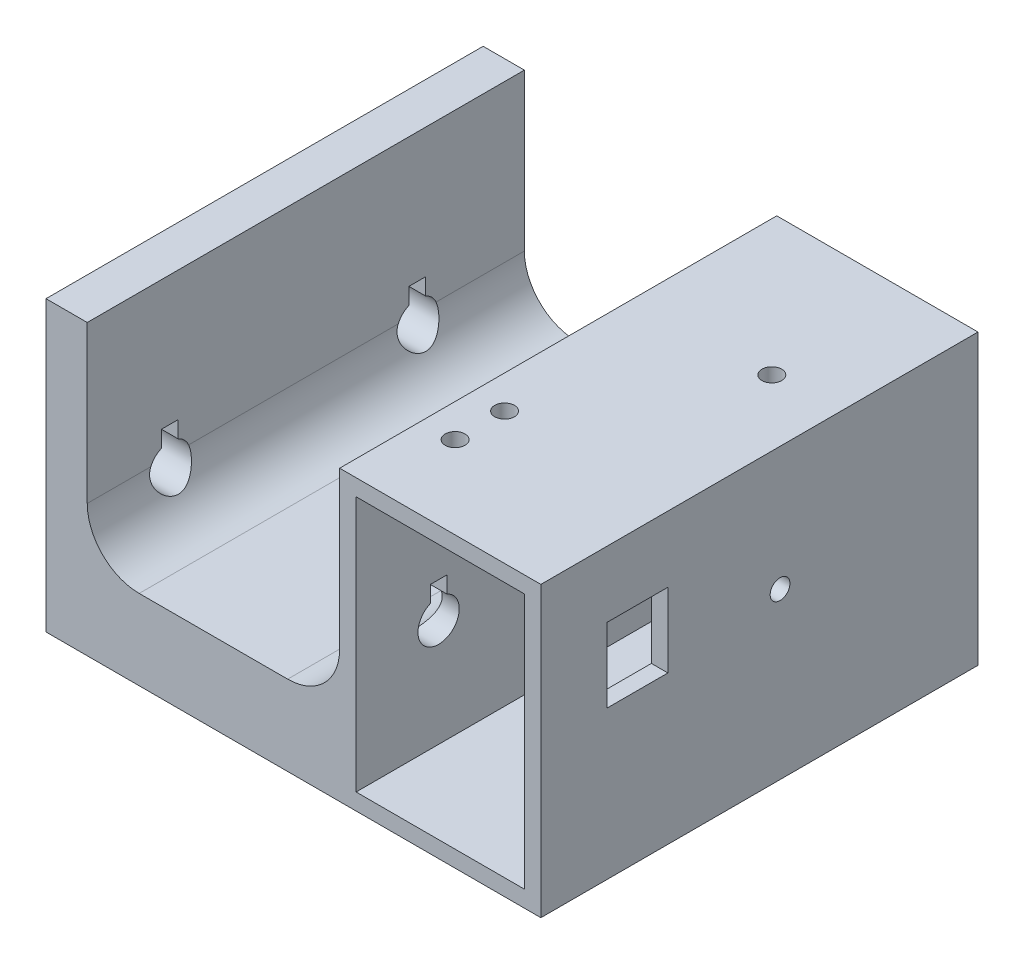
from build123d import *

# Parameters (mm, degrees)
BOSS_EXTRUDE1_DEPTH = 67.31
SKETCH4_W           = 25.908
SKETCH4_H           = 39.37
CUT_EXTRUDE3_DEPTH  = 63.5
CUT_EXTRUDE1_REACH  = 112.963
SKETCH5_R           = 1.524
CUT_EXTRUDE4_DEPTH  = 2.54
SKETCH6_R           = 1.524
SKETCH6_W           = 9.398
SKETCH6_H           = 11.43
CUT_EXTRUDE5_DEPTH  = 2.54


with BuildPart() as part:
    # Sketch1 → Boss-Extrude1 (new body)
    with BuildSketch(Plane.XY):
        with BuildLine():
            Line((45.212, 44.45), (76.2, 44.45))
            Line((76.2, 44.45), (76.2, 0))
            Line((76.2, 0), (0, 0))
            Line((0, 0), (0, 44.45))
            Line((0, 44.45), (6.35, 44.45))
            Line((6.35, 44.45), (6.35, 20.32))
            ThreePointArc((6.35, 20.32), (8.693438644, 14.662438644), (14.351, 12.319))
            Line((14.351, 12.319), (37.211, 12.319))
            ThreePointArc((37.211, 12.319), (42.868561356, 14.662438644), (45.212, 20.32))
            Line((45.212, 20.32), (45.212, 44.45))
        make_face()
    extrude(amount=BOSS_EXTRUDE1_DEPTH)

    # Sketch4 → Cut-Extrude3 (cut)
    with BuildSketch(Plane.XY.offset(67.31)):
        with Locations((60.706, 22.225)):
            Rectangle(SKETCH4_W, SKETCH4_H)
    extrude(amount=-CUT_EXTRUDE3_DEPTH, mode=Mode.SUBTRACT)

    # Cut-Extrude1: up to this face of the body (flat: up to its plane)
    cut_extrude1_end = Plane(part.part.faces().sort_by_distance((47.752, 22.225, 35.56))[0])
    # Sketch2 → Cut-Extrude1 (cut, up to the picked face)
    with BuildSketch(Plane.ZY, mode=Mode.PRIVATE) as cut_extrude1_sk1:
        with BuildLine():
            Line((15.24, 21.959935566), (15.24, 24.499935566))
            Line((15.24, 24.499935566), (17.78, 24.499935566))
            Line((17.78, 24.499935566), (17.78, 21.959935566))
            ThreePointArc((17.78, 21.959935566), (16.51, 15.875), (15.24, 21.959935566))
        make_face()
    cut_extrude1_tool1 = split(extrude(cut_extrude1_sk1.sketch, amount=-CUT_EXTRUDE1_REACH, mode=Mode.PRIVATE), bisect_by=cut_extrude1_end, keep=Keep.BOTH, mode=Mode.PRIVATE)
    # Sketch2 → Cut-Extrude1 (cut, up to the picked face)
    with BuildSketch(Plane.ZY, mode=Mode.PRIVATE) as cut_extrude1_sk2:
        with BuildLine():
            Line((53.34, 21.959935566), (53.34, 24.499935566))
            Line((53.34, 24.499935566), (55.88, 24.499935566))
            Line((55.88, 24.499935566), (55.88, 21.959935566))
            ThreePointArc((55.88, 21.959935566), (54.61, 15.875), (53.34, 21.959935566))
        make_face()
    cut_extrude1_tool2 = split(extrude(cut_extrude1_sk2.sketch, amount=-CUT_EXTRUDE1_REACH, mode=Mode.PRIVATE), bisect_by=cut_extrude1_end, keep=Keep.BOTH, mode=Mode.PRIVATE)
    add(cut_extrude1_tool1.solids().sort_by(Axis((0, 19.729665, 16.51), (1, 0, 0)))[0], mode=Mode.SUBTRACT)
    add(cut_extrude1_tool2.solids().sort_by(Axis((0, 19.729665, 54.61), (1, 0, 0)))[0], mode=Mode.SUBTRACT)

    # Sketch5 → Cut-Extrude4 (cut)
    with BuildSketch(Plane(origin=(0, 44.45, 0), x_dir=(1, 0, 0), z_dir=(0, 1, 0))):
        with Locations(Location((50.292, -46.99, 0), (0, 0, 270))):
            Circle(SKETCH5_R)
        with Locations(Location((50.292, -54.61, 0), (0, 0, 270))):
            Circle(SKETCH5_R)
        with Locations(Location((66.04, -21.59, 0), (0, 0, 270))):
            Circle(SKETCH5_R)
    extrude(amount=-CUT_EXTRUDE4_DEPTH, mode=Mode.SUBTRACT)

    # Sketch6 → Cut-Extrude5 (cut)
    with BuildSketch(Plane(origin=(76.2, 0, 0), x_dir=(0, 0, -1), z_dir=(1, 0, 0))):
        with Locations((-30.48, 25.4)):
            Circle(SKETCH6_R)
        with Locations((-52.451, 28.575)):
            Rectangle(SKETCH6_W, SKETCH6_H)
    extrude(amount=-CUT_EXTRUDE5_DEPTH, mode=Mode.SUBTRACT)


solid = part.part
